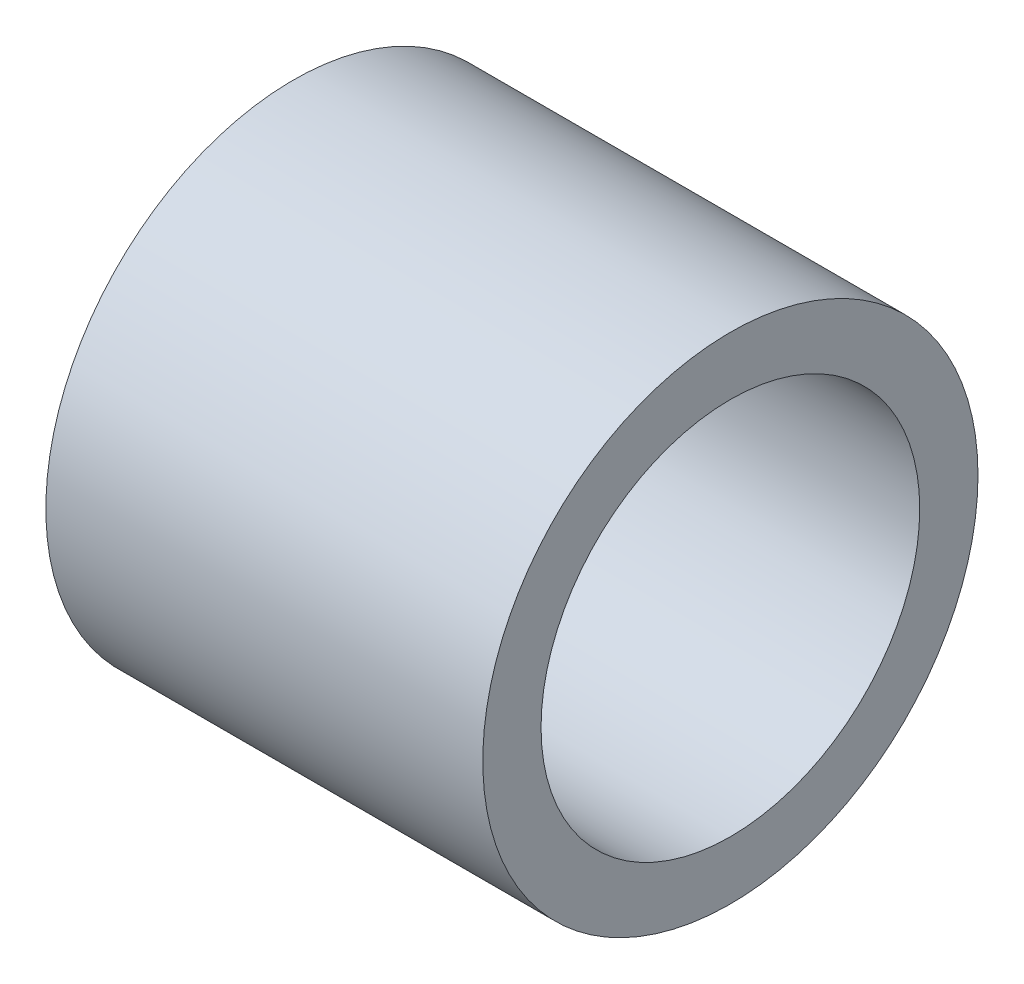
ISO-10303-21;
HEADER;
FILE_DESCRIPTION(('STEP AP214'),'2;1');
FILE_NAME('part.step','',(''),(''),'','','');
FILE_SCHEMA(('AUTOMOTIVE_DESIGN { 1 0 10303 214 1 1 1 1 }'));
ENDSEC;
DATA;
#1=APPLICATION_CONTEXT('core data for automotive mechanical design processes');
#2=APPLICATION_PROTOCOL_DEFINITION('international standard','automotive_design',2000,#1);
#3=PRODUCT_CONTEXT('',#1,'mechanical');
#4=PRODUCT('Part','Part','',(#3));
#5=PRODUCT_RELATED_PRODUCT_CATEGORY('part','',(#4));
#6=PRODUCT_DEFINITION_FORMATION('','',#4);
#7=PRODUCT_DEFINITION_CONTEXT('part definition',#1,'design');
#8=PRODUCT_DEFINITION('design','',#6,#7);
#9=PRODUCT_DEFINITION_SHAPE('','',#8);
#10=(LENGTH_UNIT() NAMED_UNIT(*) SI_UNIT(.MILLI.,.METRE.));
#11=(NAMED_UNIT(*) PLANE_ANGLE_UNIT() SI_UNIT($,.RADIAN.));
#12=(NAMED_UNIT(*) SI_UNIT($,.STERADIAN.) SOLID_ANGLE_UNIT());
#13=UNCERTAINTY_MEASURE_WITH_UNIT(LENGTH_MEASURE(1.E-05),#10,'distance_accuracy_value','');
#14=(GEOMETRIC_REPRESENTATION_CONTEXT(3) GLOBAL_UNCERTAINTY_ASSIGNED_CONTEXT((#13)) GLOBAL_UNIT_ASSIGNED_CONTEXT((#10,
#11,#12)) REPRESENTATION_CONTEXT('',''));
#15=CARTESIAN_POINT('',(0.,0.,0.));
#16=DIRECTION('',(0.,0.,1.));
#17=DIRECTION('',(1.,0.,0.));
#18=AXIS2_PLACEMENT_3D('',#15,#16,#17);
#19=CARTESIAN_POINT('',(15.,0.,0.));
#20=DIRECTION('',(-1.,0.,0.));
#21=DIRECTION('',(0.,0.,1.));
#22=AXIS2_PLACEMENT_3D('',#19,#20,#21);
#23=CYLINDRICAL_SURFACE('',#22,8.5);
#24=CARTESIAN_POINT('',(15.,0.,0.));
#25=DIRECTION('',(1.,0.,0.));
#26=DIRECTION('',(0.,0.,-1.));
#27=AXIS2_PLACEMENT_3D('',#24,#25,#26);
#28=CIRCLE('',#27,8.5);
#29=CARTESIAN_POINT('',(15.,0.,-8.5));
#30=VERTEX_POINT('',#29);
#31=EDGE_CURVE('E10',#30,#30,#28,.T.);
#32=ORIENTED_EDGE('',*,*,#31,.F.);
#33=EDGE_LOOP('',(#32));
#34=FACE_BOUND('',#33,.T.);
#35=CARTESIAN_POINT('',(0.,0.,0.));
#36=DIRECTION('',(1.,0.,0.));
#37=DIRECTION('',(0.,0.,-1.));
#38=AXIS2_PLACEMENT_3D('',#35,#36,#37);
#39=CIRCLE('',#38,8.5);
#40=CARTESIAN_POINT('',(0.,0.,-8.5));
#41=VERTEX_POINT('',#40);
#42=EDGE_CURVE('E44',#41,#41,#39,.T.);
#43=ORIENTED_EDGE('',*,*,#42,.T.);
#44=EDGE_LOOP('',(#43));
#45=FACE_BOUND('',#44,.T.);
#46=ADVANCED_FACE('F41',(#34,#45),#23,.T.);
#47=CARTESIAN_POINT('',(15.,0.,0.));
#48=DIRECTION('',(1.,0.,0.));
#49=DIRECTION('',(0.,0.,-1.));
#50=AXIS2_PLACEMENT_3D('',#47,#48,#49);
#51=PLANE('',#50);
#52=CARTESIAN_POINT('',(15.,0.,0.));
#53=DIRECTION('',(1.,0.,0.));
#54=DIRECTION('',(0.,0.,-1.));
#55=AXIS2_PLACEMENT_3D('',#52,#53,#54);
#56=CIRCLE('',#55,6.5);
#57=CARTESIAN_POINT('',(15.,0.,-6.5));
#58=VERTEX_POINT('',#57);
#59=EDGE_CURVE('E55',#58,#58,#56,.T.);
#60=ORIENTED_EDGE('',*,*,#59,.F.);
#61=EDGE_LOOP('',(#60));
#62=FACE_BOUND('',#61,.T.);
#63=ORIENTED_EDGE('',*,*,#31,.T.);
#64=EDGE_LOOP('',(#63));
#65=FACE_BOUND('',#64,.T.);
#66=ADVANCED_FACE('F72',(#62,#65),#51,.T.);
#67=CARTESIAN_POINT('',(0.,0.,0.));
#68=DIRECTION('',(1.,0.,0.));
#69=DIRECTION('',(0.,0.,-1.));
#70=AXIS2_PLACEMENT_3D('',#67,#68,#69);
#71=PLANE('',#70);
#72=CARTESIAN_POINT('',(0.,0.,0.));
#73=DIRECTION('',(1.,0.,0.));
#74=DIRECTION('',(0.,0.,-1.));
#75=AXIS2_PLACEMENT_3D('',#72,#73,#74);
#76=CIRCLE('',#75,6.5);
#77=CARTESIAN_POINT('',(0.,0.,-6.5));
#78=VERTEX_POINT('',#77);
#79=EDGE_CURVE('E53',#78,#78,#76,.T.);
#80=ORIENTED_EDGE('',*,*,#79,.T.);
#81=EDGE_LOOP('',(#80));
#82=FACE_BOUND('',#81,.T.);
#83=ORIENTED_EDGE('',*,*,#42,.F.);
#84=EDGE_LOOP('',(#83));
#85=FACE_BOUND('',#84,.T.);
#86=ADVANCED_FACE('F63',(#82,#85),#71,.F.);
#87=CARTESIAN_POINT('',(0.,0.,0.));
#88=DIRECTION('',(1.,0.,0.));
#89=DIRECTION('',(0.,0.,-1.));
#90=AXIS2_PLACEMENT_3D('',#87,#88,#89);
#91=CYLINDRICAL_SURFACE('',#90,6.5);
#92=ORIENTED_EDGE('',*,*,#79,.F.);
#93=EDGE_LOOP('',(#92));
#94=FACE_BOUND('',#93,.T.);
#95=ORIENTED_EDGE('',*,*,#59,.T.);
#96=EDGE_LOOP('',(#95));
#97=FACE_BOUND('',#96,.T.);
#98=ADVANCED_FACE('F66',(#94,#97),#91,.F.);
#99=CLOSED_SHELL('',(#46,#66,#86,#98));
#100=MANIFOLD_SOLID_BREP('B2',#99);
#101=ADVANCED_BREP_SHAPE_REPRESENTATION('',(#18,#100),#14);
#102=SHAPE_DEFINITION_REPRESENTATION(#9,#101);
ENDSEC;
END-ISO-10303-21;
